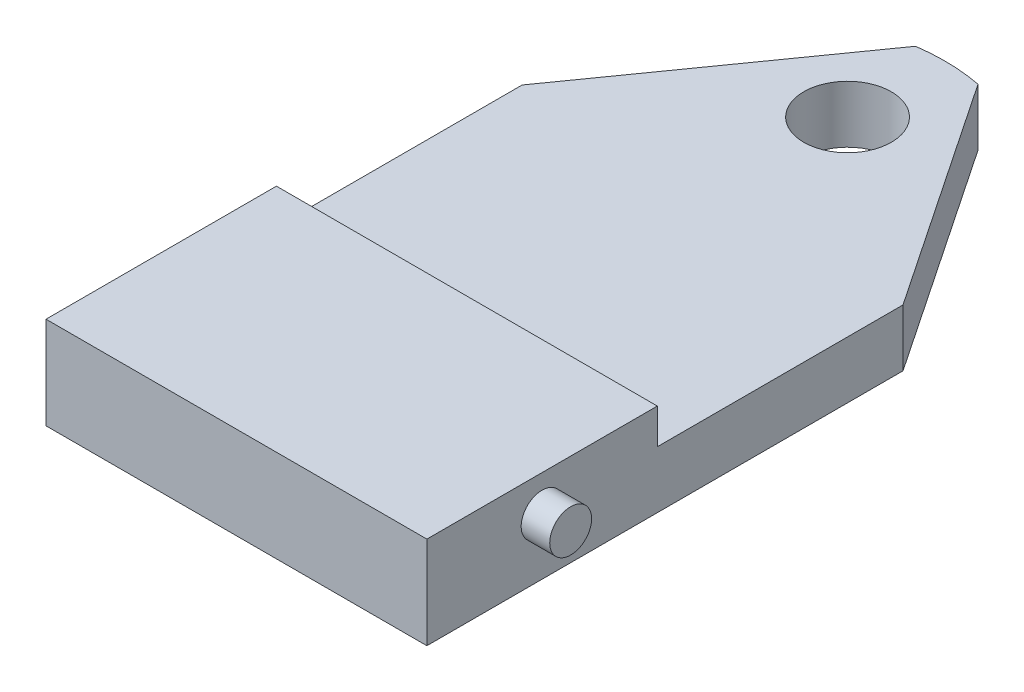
ISO-10303-21;
HEADER;
FILE_DESCRIPTION(('STEP AP214'),'2;1');
FILE_NAME('part.step','',(''),(''),'','','');
FILE_SCHEMA(('AUTOMOTIVE_DESIGN { 1 0 10303 214 1 1 1 1 }'));
ENDSEC;
DATA;
#1=APPLICATION_CONTEXT('core data for automotive mechanical design processes');
#2=APPLICATION_PROTOCOL_DEFINITION('international standard','automotive_design',2000,#1);
#3=PRODUCT_CONTEXT('',#1,'mechanical');
#4=PRODUCT('Part','Part','',(#3));
#5=PRODUCT_RELATED_PRODUCT_CATEGORY('part','',(#4));
#6=PRODUCT_DEFINITION_FORMATION('','',#4);
#7=PRODUCT_DEFINITION_CONTEXT('part definition',#1,'design');
#8=PRODUCT_DEFINITION('design','',#6,#7);
#9=PRODUCT_DEFINITION_SHAPE('','',#8);
#10=(LENGTH_UNIT() NAMED_UNIT(*) SI_UNIT(.MILLI.,.METRE.));
#11=(NAMED_UNIT(*) PLANE_ANGLE_UNIT() SI_UNIT($,.RADIAN.));
#12=(NAMED_UNIT(*) SI_UNIT($,.STERADIAN.) SOLID_ANGLE_UNIT());
#13=UNCERTAINTY_MEASURE_WITH_UNIT(LENGTH_MEASURE(1.E-05),#10,'distance_accuracy_value','');
#14=(GEOMETRIC_REPRESENTATION_CONTEXT(3) GLOBAL_UNCERTAINTY_ASSIGNED_CONTEXT((#13)) GLOBAL_UNIT_ASSIGNED_CONTEXT((#10,
#11,#12)) REPRESENTATION_CONTEXT('',''));
#15=CARTESIAN_POINT('',(0.,0.,0.));
#16=DIRECTION('',(0.,0.,1.));
#17=DIRECTION('',(1.,0.,0.));
#18=AXIS2_PLACEMENT_3D('',#15,#16,#17);
#19=CARTESIAN_POINT('',(10.,3.,13.0065727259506));
#20=DIRECTION('',(0.,-1.,0.));
#21=DIRECTION('',(0.,0.,-1.));
#22=AXIS2_PLACEMENT_3D('',#19,#20,#21);
#23=PLANE('',#22);
#24=CARTESIAN_POINT('',(10.,3.,7.91178286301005));
#25=DIRECTION('',(0.,1.,0.));
#26=DIRECTION('',(0.,0.,1.));
#27=AXIS2_PLACEMENT_3D('',#24,#25,#26);
#28=CIRCLE('',#27,2.3);
#29=CARTESIAN_POINT('',(10.,3.,10.2117828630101));
#30=VERTEX_POINT('',#29);
#31=EDGE_CURVE('E144',#30,#30,#28,.T.);
#32=ORIENTED_EDGE('',*,*,#31,.F.);
#33=EDGE_LOOP('',(#32));
#34=FACE_BOUND('',#33,.T.);
#35=DIRECTION('',(-1.,0.,0.));
#36=VECTOR('',#35,1.);
#37=CARTESIAN_POINT('',(32.240608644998,3.,27.9));
#38=LINE('',#37,#36);
#39=CARTESIAN_POINT('',(20.,3.,27.9));
#40=VERTEX_POINT('',#39);
#41=CARTESIAN_POINT('',(0.,3.,27.9));
#42=VERTEX_POINT('',#41);
#43=EDGE_CURVE('E57',#40,#42,#38,.T.);
#44=ORIENTED_EDGE('',*,*,#43,.F.);
#45=DIRECTION('',(0.,0.,-1.));
#46=VECTOR('',#45,1.);
#47=CARTESIAN_POINT('',(20.,3.,15.));
#48=LINE('',#47,#46);
#49=CARTESIAN_POINT('',(20.,3.,15.));
#50=VERTEX_POINT('',#49);
#51=EDGE_CURVE('E116',#40,#50,#48,.T.);
#52=ORIENTED_EDGE('',*,*,#51,.T.);
#53=DIRECTION('',(-0.557738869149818,0.,-0.830016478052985));
#54=VECTOR('',#53,1.);
#55=CARTESIAN_POINT('',(20.,3.,15.));
#56=LINE('',#55,#54);
#57=CARTESIAN_POINT('',(11.932902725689,3.,2.99469780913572));
#58=VERTEX_POINT('',#57);
#59=EDGE_CURVE('E153',#50,#58,#56,.T.);
#60=ORIENTED_EDGE('',*,*,#59,.T.);
#61=CARTESIAN_POINT('',(10.,3.,13.0065727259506));
#62=DIRECTION('',(0.,1.,0.));
#63=DIRECTION('',(0.,0.,-1.));
#64=AXIS2_PLACEMENT_3D('',#61,#62,#63);
#65=CIRCLE('',#64,10.1967520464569);
#66=CARTESIAN_POINT('',(8.56653074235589,3.,2.91108273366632));
#67=VERTEX_POINT('',#66);
#68=EDGE_CURVE('E65',#58,#67,#65,.T.);
#69=ORIENTED_EDGE('',*,*,#68,.T.);
#70=DIRECTION('',(-0.578176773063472,0.,0.815911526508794));
#71=VECTOR('',#70,1.);
#72=CARTESIAN_POINT('',(0.,3.,15.));
#73=LINE('',#72,#71);
#74=CARTESIAN_POINT('',(0.,3.,15.));
#75=VERTEX_POINT('',#74);
#76=EDGE_CURVE('E114',#67,#75,#73,.T.);
#77=ORIENTED_EDGE('',*,*,#76,.T.);
#78=DIRECTION('',(0.,0.,1.));
#79=VECTOR('',#78,1.);
#80=CARTESIAN_POINT('',(0.,3.,15.));
#81=LINE('',#80,#79);
#82=EDGE_CURVE('E99',#75,#42,#81,.T.);
#83=ORIENTED_EDGE('',*,*,#82,.T.);
#84=EDGE_LOOP('',(#44,#52,#60,#69,#77,#83));
#85=FACE_BOUND('',#84,.T.);
#86=ADVANCED_FACE('F42',(#34,#85),#23,.F.);
#87=CARTESIAN_POINT('',(10.,0.,13.0065727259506));
#88=DIRECTION('',(0.,-1.,0.));
#89=DIRECTION('',(0.,0.,-1.));
#90=AXIS2_PLACEMENT_3D('',#87,#88,#89);
#91=PLANE('',#90);
#92=DIRECTION('',(-0.578176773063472,0.,0.815911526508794));
#93=VECTOR('',#92,1.);
#94=CARTESIAN_POINT('',(0.,0.,15.));
#95=LINE('',#94,#93);
#96=CARTESIAN_POINT('',(8.56653074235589,0.,2.91108273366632));
#97=VERTEX_POINT('',#96);
#98=CARTESIAN_POINT('',(0.,0.,15.));
#99=VERTEX_POINT('',#98);
#100=EDGE_CURVE('E147',#97,#99,#95,.T.);
#101=ORIENTED_EDGE('',*,*,#100,.F.);
#102=CARTESIAN_POINT('',(10.,0.,13.0065727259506));
#103=DIRECTION('',(0.,1.,0.));
#104=DIRECTION('',(0.,0.,-1.));
#105=AXIS2_PLACEMENT_3D('',#102,#103,#104);
#106=CIRCLE('',#105,10.1967520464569);
#107=CARTESIAN_POINT('',(11.932902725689,0.,2.99469780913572));
#108=VERTEX_POINT('',#107);
#109=EDGE_CURVE('E92',#108,#97,#106,.T.);
#110=ORIENTED_EDGE('',*,*,#109,.F.);
#111=DIRECTION('',(-0.557738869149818,0.,-0.830016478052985));
#112=VECTOR('',#111,1.);
#113=CARTESIAN_POINT('',(20.,0.,15.));
#114=LINE('',#113,#112);
#115=CARTESIAN_POINT('',(20.,0.,15.));
#116=VERTEX_POINT('',#115);
#117=EDGE_CURVE('E165',#116,#108,#114,.T.);
#118=ORIENTED_EDGE('',*,*,#117,.F.);
#119=DIRECTION('',(0.,0.,-1.));
#120=VECTOR('',#119,1.);
#121=CARTESIAN_POINT('',(20.,0.,15.));
#122=LINE('',#121,#120);
#123=CARTESIAN_POINT('',(20.,0.,40.));
#124=VERTEX_POINT('',#123);
#125=EDGE_CURVE('E163',#124,#116,#122,.T.);
#126=ORIENTED_EDGE('',*,*,#125,.F.);
#127=DIRECTION('',(1.,0.,0.));
#128=VECTOR('',#127,1.);
#129=CARTESIAN_POINT('',(0.,0.,40.));
#130=LINE('',#129,#128);
#131=CARTESIAN_POINT('',(0.,0.,40.));
#132=VERTEX_POINT('',#131);
#133=EDGE_CURVE('E161',#132,#124,#130,.T.);
#134=ORIENTED_EDGE('',*,*,#133,.F.);
#135=DIRECTION('',(0.,0.,1.));
#136=VECTOR('',#135,1.);
#137=CARTESIAN_POINT('',(0.,0.,15.));
#138=LINE('',#137,#136);
#139=EDGE_CURVE('E159',#99,#132,#138,.T.);
#140=ORIENTED_EDGE('',*,*,#139,.F.);
#141=EDGE_LOOP('',(#101,#110,#118,#126,#134,#140));
#142=FACE_BOUND('',#141,.T.);
#143=CARTESIAN_POINT('',(10.,0.,7.91178286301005));
#144=DIRECTION('',(0.,1.,0.));
#145=DIRECTION('',(0.,0.,1.));
#146=AXIS2_PLACEMENT_3D('',#143,#144,#145);
#147=CIRCLE('',#146,2.3);
#148=CARTESIAN_POINT('',(10.,0.,10.2117828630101));
#149=VERTEX_POINT('',#148);
#150=EDGE_CURVE('E148',#149,#149,#147,.T.);
#151=ORIENTED_EDGE('',*,*,#150,.T.);
#152=EDGE_LOOP('',(#151));
#153=FACE_BOUND('',#152,.T.);
#154=ADVANCED_FACE('F182',(#142,#153),#91,.T.);
#155=CARTESIAN_POINT('',(0.,3.,15.));
#156=DIRECTION('',(0.815911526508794,0.,0.578176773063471));
#157=DIRECTION('',(0.578176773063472,0.,-0.815911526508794));
#158=AXIS2_PLACEMENT_3D('',#155,#156,#157);
#159=PLANE('',#158);
#160=ORIENTED_EDGE('',*,*,#100,.T.);
#161=DIRECTION('',(0.,-1.,0.));
#162=VECTOR('',#161,1.);
#163=CARTESIAN_POINT('',(0.,3.,15.));
#164=LINE('',#163,#162);
#165=EDGE_CURVE('E50',#75,#99,#164,.T.);
#166=ORIENTED_EDGE('',*,*,#165,.F.);
#167=ORIENTED_EDGE('',*,*,#76,.F.);
#168=DIRECTION('',(0.,-1.,0.));
#169=VECTOR('',#168,1.);
#170=CARTESIAN_POINT('',(8.56653074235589,3.,2.91108273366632));
#171=LINE('',#170,#169);
#172=EDGE_CURVE('E156',#67,#97,#171,.T.);
#173=ORIENTED_EDGE('',*,*,#172,.T.);
#174=EDGE_LOOP('',(#160,#166,#167,#173));
#175=FACE_BOUND('',#174,.T.);
#176=ADVANCED_FACE('F44',(#175),#159,.F.);
#177=CARTESIAN_POINT('',(0.,3.,15.));
#178=DIRECTION('',(1.,0.,0.));
#179=DIRECTION('',(0.,0.,-1.));
#180=AXIS2_PLACEMENT_3D('',#177,#178,#179);
#181=PLANE('',#180);
#182=ORIENTED_EDGE('',*,*,#139,.T.);
#183=DIRECTION('',(0.,-1.,0.));
#184=VECTOR('',#183,1.);
#185=CARTESIAN_POINT('',(0.,3.,40.));
#186=LINE('',#185,#184);
#187=CARTESIAN_POINT('',(0.,4.85,40.));
#188=VERTEX_POINT('',#187);
#189=EDGE_CURVE('E177',#188,#132,#186,.T.);
#190=ORIENTED_EDGE('',*,*,#189,.F.);
#191=DIRECTION('',(0.,0.,1.));
#192=VECTOR('',#191,1.);
#193=CARTESIAN_POINT('',(0.,4.85,15.));
#194=LINE('',#193,#192);
#195=CARTESIAN_POINT('',(0.,4.85,27.9));
#196=VERTEX_POINT('',#195);
#197=EDGE_CURVE('E131',#196,#188,#194,.T.);
#198=ORIENTED_EDGE('',*,*,#197,.F.);
#199=DIRECTION('',(0.,1.,0.));
#200=VECTOR('',#199,1.);
#201=CARTESIAN_POINT('',(0.,3.,27.9));
#202=LINE('',#201,#200);
#203=EDGE_CURVE('E123',#42,#196,#202,.T.);
#204=ORIENTED_EDGE('',*,*,#203,.F.);
#205=ORIENTED_EDGE('',*,*,#82,.F.);
#206=ORIENTED_EDGE('',*,*,#165,.T.);
#207=EDGE_LOOP('',(#182,#190,#198,#204,#205,#206));
#208=FACE_BOUND('',#207,.T.);
#209=ADVANCED_FACE('F129',(#208),#181,.F.);
#210=CARTESIAN_POINT('',(0.,3.,40.));
#211=DIRECTION('',(0.,0.,-1.));
#212=DIRECTION('',(-1.,0.,0.));
#213=AXIS2_PLACEMENT_3D('',#210,#211,#212);
#214=PLANE('',#213);
#215=ORIENTED_EDGE('',*,*,#133,.T.);
#216=DIRECTION('',(0.,-1.,0.));
#217=VECTOR('',#216,1.);
#218=CARTESIAN_POINT('',(20.,3.,40.));
#219=LINE('',#218,#217);
#220=CARTESIAN_POINT('',(20.,4.85,40.));
#221=VERTEX_POINT('',#220);
#222=EDGE_CURVE('E174',#221,#124,#219,.T.);
#223=ORIENTED_EDGE('',*,*,#222,.F.);
#224=DIRECTION('',(-1.,0.,0.));
#225=VECTOR('',#224,1.);
#226=CARTESIAN_POINT('',(32.240608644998,4.85,40.));
#227=LINE('',#226,#225);
#228=EDGE_CURVE('E134',#221,#188,#227,.T.);
#229=ORIENTED_EDGE('',*,*,#228,.T.);
#230=ORIENTED_EDGE('',*,*,#189,.T.);
#231=EDGE_LOOP('',(#215,#223,#229,#230));
#232=FACE_BOUND('',#231,.T.);
#233=ADVANCED_FACE('F188',(#232),#214,.F.);
#234=CARTESIAN_POINT('',(20.,3.,15.));
#235=DIRECTION('',(-1.,0.,0.));
#236=DIRECTION('',(0.,0.,1.));
#237=AXIS2_PLACEMENT_3D('',#234,#235,#236);
#238=PLANE('',#237);
#239=CARTESIAN_POINT('',(20.,2.95,33.95));
#240=DIRECTION('',(-1.,0.,0.));
#241=DIRECTION('',(0.,0.,1.));
#242=AXIS2_PLACEMENT_3D('',#239,#240,#241);
#243=CIRCLE('',#242,1.1);
#244=CARTESIAN_POINT('',(20.,2.95,35.05));
#245=VERTEX_POINT('',#244);
#246=EDGE_CURVE('E11',#245,#245,#243,.F.);
#247=ORIENTED_EDGE('',*,*,#246,.F.);
#248=EDGE_LOOP('',(#247));
#249=FACE_BOUND('',#248,.T.);
#250=ORIENTED_EDGE('',*,*,#125,.T.);
#251=DIRECTION('',(0.,-1.,0.));
#252=VECTOR('',#251,1.);
#253=CARTESIAN_POINT('',(20.,3.,15.));
#254=LINE('',#253,#252);
#255=EDGE_CURVE('E171',#50,#116,#254,.T.);
#256=ORIENTED_EDGE('',*,*,#255,.F.);
#257=ORIENTED_EDGE('',*,*,#51,.F.);
#258=DIRECTION('',(0.,-1.,0.));
#259=VECTOR('',#258,1.);
#260=CARTESIAN_POINT('',(20.,3.,27.9));
#261=LINE('',#260,#259);
#262=CARTESIAN_POINT('',(20.,4.85,27.9));
#263=VERTEX_POINT('',#262);
#264=EDGE_CURVE('E125',#263,#40,#261,.T.);
#265=ORIENTED_EDGE('',*,*,#264,.F.);
#266=DIRECTION('',(0.,0.,-1.));
#267=VECTOR('',#266,1.);
#268=CARTESIAN_POINT('',(20.,4.85,15.));
#269=LINE('',#268,#267);
#270=EDGE_CURVE('E126',#221,#263,#269,.T.);
#271=ORIENTED_EDGE('',*,*,#270,.F.);
#272=ORIENTED_EDGE('',*,*,#222,.T.);
#273=EDGE_LOOP('',(#250,#256,#257,#265,#271,#272));
#274=FACE_BOUND('',#273,.T.);
#275=ADVANCED_FACE('F191',(#249,#274),#238,.F.);
#276=CARTESIAN_POINT('',(20.,3.,15.));
#277=DIRECTION('',(-0.830016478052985,0.,0.557738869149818));
#278=DIRECTION('',(0.557738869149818,0.,0.830016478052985));
#279=AXIS2_PLACEMENT_3D('',#276,#277,#278);
#280=PLANE('',#279);
#281=ORIENTED_EDGE('',*,*,#117,.T.);
#282=DIRECTION('',(0.,-1.,0.));
#283=VECTOR('',#282,1.);
#284=CARTESIAN_POINT('',(11.932902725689,3.,2.99469780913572));
#285=LINE('',#284,#283);
#286=EDGE_CURVE('E169',#58,#108,#285,.T.);
#287=ORIENTED_EDGE('',*,*,#286,.F.);
#288=ORIENTED_EDGE('',*,*,#59,.F.);
#289=ORIENTED_EDGE('',*,*,#255,.T.);
#290=EDGE_LOOP('',(#281,#287,#288,#289));
#291=FACE_BOUND('',#290,.T.);
#292=ADVANCED_FACE('F221',(#291),#280,.F.);
#293=CARTESIAN_POINT('',(10.,3.,13.0065727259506));
#294=DIRECTION('',(0.,-1.,0.));
#295=DIRECTION('',(0.,0.,-1.));
#296=AXIS2_PLACEMENT_3D('',#293,#294,#295);
#297=CYLINDRICAL_SURFACE('',#296,10.1967520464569);
#298=ORIENTED_EDGE('',*,*,#109,.T.);
#299=ORIENTED_EDGE('',*,*,#172,.F.);
#300=ORIENTED_EDGE('',*,*,#68,.F.);
#301=ORIENTED_EDGE('',*,*,#286,.T.);
#302=EDGE_LOOP('',(#298,#299,#300,#301));
#303=FACE_BOUND('',#302,.T.);
#304=ADVANCED_FACE('F206',(#303),#297,.T.);
#305=CARTESIAN_POINT('',(10.,3.,7.91178286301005));
#306=DIRECTION('',(0.,-1.,0.));
#307=DIRECTION('',(0.,0.,-1.));
#308=AXIS2_PLACEMENT_3D('',#305,#306,#307);
#309=CYLINDRICAL_SURFACE('',#308,2.3);
#310=ORIENTED_EDGE('',*,*,#31,.T.);
#311=EDGE_LOOP('',(#310));
#312=FACE_BOUND('',#311,.T.);
#313=ORIENTED_EDGE('',*,*,#150,.F.);
#314=EDGE_LOOP('',(#313));
#315=FACE_BOUND('',#314,.T.);
#316=ADVANCED_FACE('F198',(#312,#315),#309,.F.);
#317=CARTESIAN_POINT('',(32.240608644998,4.85,15.));
#318=DIRECTION('',(0.,-1.,0.));
#319=DIRECTION('',(0.,0.,-1.));
#320=AXIS2_PLACEMENT_3D('',#317,#318,#319);
#321=PLANE('',#320);
#322=ORIENTED_EDGE('',*,*,#228,.F.);
#323=ORIENTED_EDGE('',*,*,#270,.T.);
#324=DIRECTION('',(-1.,0.,0.));
#325=VECTOR('',#324,1.);
#326=CARTESIAN_POINT('',(32.240608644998,4.85,27.9));
#327=LINE('',#326,#325);
#328=EDGE_CURVE('E127',#263,#196,#327,.T.);
#329=ORIENTED_EDGE('',*,*,#328,.T.);
#330=ORIENTED_EDGE('',*,*,#197,.T.);
#331=EDGE_LOOP('',(#322,#323,#329,#330));
#332=FACE_BOUND('',#331,.T.);
#333=ADVANCED_FACE('F196',(#332),#321,.F.);
#334=CARTESIAN_POINT('',(32.240608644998,3.,27.9));
#335=DIRECTION('',(0.,0.,1.));
#336=DIRECTION('',(1.,0.,0.));
#337=AXIS2_PLACEMENT_3D('',#334,#335,#336);
#338=PLANE('',#337);
#339=ORIENTED_EDGE('',*,*,#328,.F.);
#340=ORIENTED_EDGE('',*,*,#264,.T.);
#341=ORIENTED_EDGE('',*,*,#43,.T.);
#342=ORIENTED_EDGE('',*,*,#203,.T.);
#343=EDGE_LOOP('',(#339,#340,#341,#342));
#344=FACE_BOUND('',#343,.T.);
#345=ADVANCED_FACE('F122',(#344),#338,.F.);
#346=CARTESIAN_POINT('',(21.5,2.95,33.95));
#347=DIRECTION('',(-1.,0.,0.));
#348=DIRECTION('',(0.,0.,1.));
#349=AXIS2_PLACEMENT_3D('',#346,#347,#348);
#350=CYLINDRICAL_SURFACE('',#349,1.1);
#351=CARTESIAN_POINT('',(21.5,2.95,33.95));
#352=DIRECTION('',(1.,0.,0.));
#353=DIRECTION('',(0.,0.,-1.));
#354=AXIS2_PLACEMENT_3D('',#351,#352,#353);
#355=CIRCLE('',#354,1.1);
#356=CARTESIAN_POINT('',(21.5,2.95,32.85));
#357=VERTEX_POINT('',#356);
#358=EDGE_CURVE('E132',#357,#357,#355,.T.);
#359=ORIENTED_EDGE('',*,*,#358,.F.);
#360=EDGE_LOOP('',(#359));
#361=FACE_BOUND('',#360,.T.);
#362=ORIENTED_EDGE('',*,*,#246,.T.);
#363=EDGE_LOOP('',(#362));
#364=FACE_BOUND('',#363,.T.);
#365=ADVANCED_FACE('F204',(#361,#364),#350,.T.);
#366=CARTESIAN_POINT('',(21.5,2.95,33.95));
#367=DIRECTION('',(1.,0.,0.));
#368=DIRECTION('',(0.,0.,-1.));
#369=AXIS2_PLACEMENT_3D('',#366,#367,#368);
#370=PLANE('',#369);
#371=ORIENTED_EDGE('',*,*,#358,.T.);
#372=EDGE_LOOP('',(#371));
#373=FACE_BOUND('',#372,.T.);
#374=ADVANCED_FACE('F300',(#373),#370,.T.);
#375=CLOSED_SHELL('',(#86,#154,#176,#209,#233,#275,#292,#304,#316,#333,#345,#365,#374));
#376=MANIFOLD_SOLID_BREP('B2',#375);
#377=ADVANCED_BREP_SHAPE_REPRESENTATION('',(#18,#376),#14);
#378=SHAPE_DEFINITION_REPRESENTATION(#9,#377);
ENDSEC;
END-ISO-10303-21;
